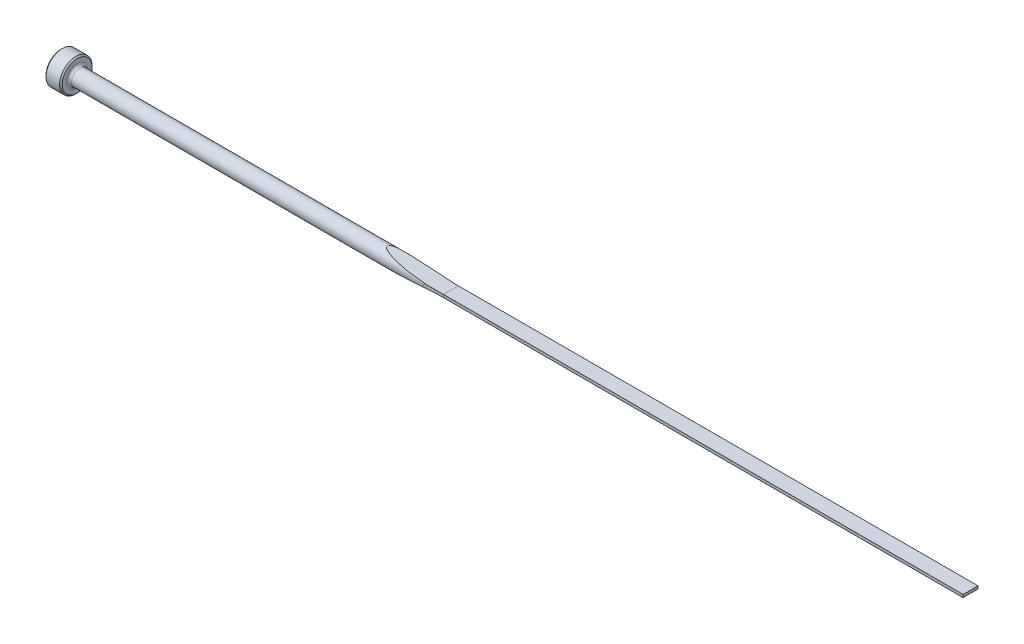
from build123d import *

# Parameters (mm, degrees)
CUT_EXTRUDE1_DEPTH = 267.785031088
CUT_EXTRUDE2_DEPTH = 267.785031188
FILLET1_R          = 0.762
CHAMFER1_SIZE      = 0.381


with BuildPart() as part:
    # Sketch1 → Revolve1 (revolve)
    with BuildSketch(Plane.XY, mode=Mode.PRIVATE) as revolve1_sk:
        Polygon((0, 0), (0, 4.7625), (4.7498, 4.7625), (4.7498, 2.3749), (266.7, 2.3749), (266.7, 0), align=None)
    revolve(revolve1_sk.sketch.rotate(Axis((0, 0, 0), (1, 0, 0)), 90), axis=Axis((0, 0, 0), (1, 0, 0)))

    # Sketch2 → Cut-Extrude1 (cut, symmetric)
    with BuildSketch(Plane.XY):
        with BuildLine():
            Line((266.7, 2.3749), (266.7, 0.4064))
            Line((266.7, 0.4064), (114.3, 0.4064))
            ThreePointArc((114.3, 0.4064), (104.945865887, 0.899894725), (95.695583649, 2.3749))
            Line((95.695583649, 2.3749), (266.7, 2.3749))
        make_face()
    cut_extrude1 = extrude(amount=CUT_EXTRUDE1_DEPTH, both=True, mode=Mode.SUBTRACT)

    # Mirror1: Cut-Extrude1 across plane
    add(cut_extrude1.mirror(Plane.ZX), mode=Mode.SUBTRACT)

    # Sketch3 → Cut-Extrude2 (cut, symmetric)
    with BuildSketch(Plane(origin=(0, 0, 0), x_dir=(1, 0, 0), z_dir=(0, 1, 0))):
        with BuildLine():
            Line((266.7, 2.3749), (266.7, 2.1844))
            Line((266.7, 2.1844), (114.3, 2.1844))
            ThreePointArc((114.3, 2.1844), (111.390064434, 2.232037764), (108.483247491, 2.3749))
            Line((108.483247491, 2.3749), (266.7, 2.3749))
        make_face()
    cut_extrude2 = extrude(amount=CUT_EXTRUDE2_DEPTH, both=True, mode=Mode.SUBTRACT)

    # Mirror2: Cut-Extrude2 across plane
    add(cut_extrude2.mirror(Plane.XY), mode=Mode.SUBTRACT)

    # Fillet1
    fillet1_edges = [part.edges().sort_by_distance(p)[0] for p in [
        (4.7498, 0, -2.3749),
    ]]
    fillet(fillet1_edges, radius=FILLET1_R)

    # Chamfer1
    chamfer1_edges = [part.edges().sort_by_distance(p)[0] for p in [
        (4.7498, 0, -4.7625),
        (0, 0, -4.7625),
    ]]
    chamfer(chamfer1_edges, length=CHAMFER1_SIZE)


solid = part.part
